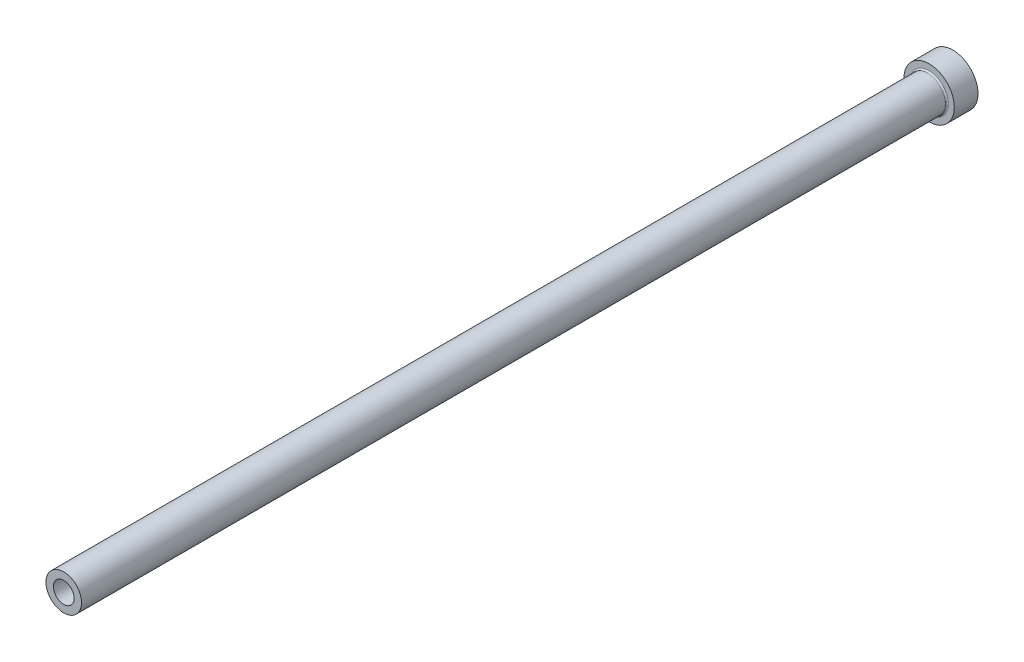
from build123d import *

# Parameters (mm, degrees)
HEAD_FILLET_R          = 0.5
ID_RELIEF_CHAMFER_SIZE = 0.5


with BuildPart() as part:
    # OD FV → Base Revolve (revolve)
    with BuildSketch(Plane(origin=(0, 0, 0), x_dir=(1, 0, 0), z_dir=(0, 1, 0))):
        Polygon((0, -300), (6, -300), (6, -8), (8.5, -8), (8.5, 0), (0, 0), align=None)
    revolve(axis=Axis((0, 0, 300), (0, 0, -1)))

    # ID FV → Hole (revolve, cut)
    with BuildSketch(Plane(origin=(0, 0, 0), x_dir=(1, 0, 0), z_dir=(0, 1, 0))):
        Polygon((0, -300), (3.5, -300), (3.5, -185), (3.75, -184.566987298), (3.75, 0), (0, 0), align=None)
    revolve(axis=Axis((0, 0, 300), (0, 0, -1)), mode=Mode.SUBTRACT)

    # Head Fillet
    head_fillet_edges = [part.edges().sort_by_distance(p)[0] for p in [
        (-6, 0, 8),
    ]]
    fillet(head_fillet_edges, radius=HEAD_FILLET_R)

    # ID Relief Chamfer
    id_relief_chamfer_edges = [part.edges().sort_by_distance(p)[0] for p in [
        (-3.75, 0, 0),
    ]]
    chamfer(id_relief_chamfer_edges, length=ID_RELIEF_CHAMFER_SIZE)


solid = part.part
